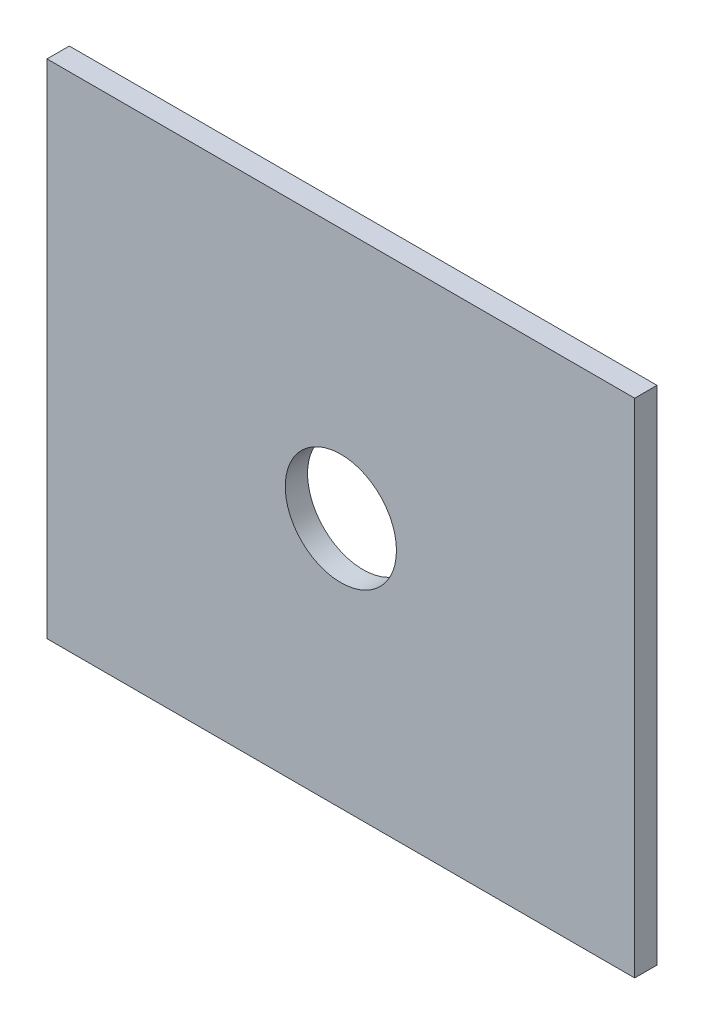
ISO-10303-21;
HEADER;
FILE_DESCRIPTION(('STEP AP214'),'2;1');
FILE_NAME('part.step','',(''),(''),'','','');
FILE_SCHEMA(('AUTOMOTIVE_DESIGN { 1 0 10303 214 1 1 1 1 }'));
ENDSEC;
DATA;
#1=APPLICATION_CONTEXT('core data for automotive mechanical design processes');
#2=APPLICATION_PROTOCOL_DEFINITION('international standard','automotive_design',2000,#1);
#3=PRODUCT_CONTEXT('',#1,'mechanical');
#4=PRODUCT('Part','Part','',(#3));
#5=PRODUCT_RELATED_PRODUCT_CATEGORY('part','',(#4));
#6=PRODUCT_DEFINITION_FORMATION('','',#4);
#7=PRODUCT_DEFINITION_CONTEXT('part definition',#1,'design');
#8=PRODUCT_DEFINITION('design','',#6,#7);
#9=PRODUCT_DEFINITION_SHAPE('','',#8);
#10=(LENGTH_UNIT() NAMED_UNIT(*) SI_UNIT(.MILLI.,.METRE.));
#11=(NAMED_UNIT(*) PLANE_ANGLE_UNIT() SI_UNIT($,.RADIAN.));
#12=(NAMED_UNIT(*) SI_UNIT($,.STERADIAN.) SOLID_ANGLE_UNIT());
#13=UNCERTAINTY_MEASURE_WITH_UNIT(LENGTH_MEASURE(1.E-05),#10,'distance_accuracy_value','');
#14=(GEOMETRIC_REPRESENTATION_CONTEXT(3) GLOBAL_UNCERTAINTY_ASSIGNED_CONTEXT((#13)) GLOBAL_UNIT_ASSIGNED_CONTEXT((#10,
#11,#12)) REPRESENTATION_CONTEXT('',''));
#15=CARTESIAN_POINT('',(0.,0.,0.));
#16=DIRECTION('',(0.,0.,1.));
#17=DIRECTION('',(1.,0.,0.));
#18=AXIS2_PLACEMENT_3D('',#15,#16,#17);
#19=CARTESIAN_POINT('',(-75.1547731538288,-72.4394327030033,6.));
#20=DIRECTION('',(0.,0.,1.));
#21=DIRECTION('',(1.,0.,0.));
#22=AXIS2_PLACEMENT_3D('',#19,#20,#21);
#23=PLANE('',#22);
#24=DIRECTION('',(0.,-1.,0.));
#25=VECTOR('',#24,1.);
#26=CARTESIAN_POINT('',(-75.1547731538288,62.5605672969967,6.));
#27=LINE('',#26,#25);
#28=CARTESIAN_POINT('',(-75.1547731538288,62.5605672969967,6.));
#29=VERTEX_POINT('',#28);
#30=CARTESIAN_POINT('',(-75.1547731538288,-72.4394327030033,6.));
#31=VERTEX_POINT('',#30);
#32=EDGE_CURVE('E83',#29,#31,#27,.T.);
#33=ORIENTED_EDGE('',*,*,#32,.T.);
#34=DIRECTION('',(1.,0.,0.));
#35=VECTOR('',#34,1.);
#36=CARTESIAN_POINT('',(-75.1547731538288,-72.4394327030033,6.));
#37=LINE('',#36,#35);
#38=CARTESIAN_POINT('',(82.8452268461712,-72.4394327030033,6.));
#39=VERTEX_POINT('',#38);
#40=EDGE_CURVE('E78',#31,#39,#37,.T.);
#41=ORIENTED_EDGE('',*,*,#40,.T.);
#42=DIRECTION('',(0.,1.,0.));
#43=VECTOR('',#42,1.);
#44=CARTESIAN_POINT('',(82.8452268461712,62.5605672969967,6.));
#45=LINE('',#44,#43);
#46=CARTESIAN_POINT('',(82.8452268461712,62.5605672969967,6.));
#47=VERTEX_POINT('',#46);
#48=EDGE_CURVE('E81',#39,#47,#45,.T.);
#49=ORIENTED_EDGE('',*,*,#48,.T.);
#50=DIRECTION('',(-1.,0.,0.));
#51=VECTOR('',#50,1.);
#52=CARTESIAN_POINT('',(-75.1547731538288,62.5605672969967,6.));
#53=LINE('',#52,#51);
#54=EDGE_CURVE('E48',#47,#29,#53,.T.);
#55=ORIENTED_EDGE('',*,*,#54,.T.);
#56=EDGE_LOOP('',(#33,#41,#49,#55));
#57=FACE_BOUND('',#56,.T.);
#58=CARTESIAN_POINT('',(3.84522684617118,-4.93943270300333,6.));
#59=DIRECTION('',(0.,0.,1.));
#60=DIRECTION('',(1.,0.,0.));
#61=AXIS2_PLACEMENT_3D('',#58,#59,#60);
#62=CIRCLE('',#61,14.95);
#63=CARTESIAN_POINT('',(18.7952268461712,-4.93943270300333,6.));
#64=VERTEX_POINT('',#63);
#65=EDGE_CURVE('E98',#64,#64,#62,.T.);
#66=ORIENTED_EDGE('',*,*,#65,.F.);
#67=EDGE_LOOP('',(#66));
#68=FACE_BOUND('',#67,.T.);
#69=ADVANCED_FACE('F31',(#57,#68),#23,.T.);
#70=CARTESIAN_POINT('',(-75.1547731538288,-72.4394327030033,0.));
#71=DIRECTION('',(0.,0.,1.));
#72=DIRECTION('',(1.,0.,0.));
#73=AXIS2_PLACEMENT_3D('',#70,#71,#72);
#74=PLANE('',#73);
#75=DIRECTION('',(0.,-1.,0.));
#76=VECTOR('',#75,1.);
#77=CARTESIAN_POINT('',(-75.1547731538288,62.5605672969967,0.));
#78=LINE('',#77,#76);
#79=CARTESIAN_POINT('',(-75.1547731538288,62.5605672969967,0.));
#80=VERTEX_POINT('',#79);
#81=CARTESIAN_POINT('',(-75.1547731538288,-72.4394327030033,0.));
#82=VERTEX_POINT('',#81);
#83=EDGE_CURVE('E95',#80,#82,#78,.T.);
#84=ORIENTED_EDGE('',*,*,#83,.F.);
#85=DIRECTION('',(-1.,0.,0.));
#86=VECTOR('',#85,1.);
#87=CARTESIAN_POINT('',(-75.1547731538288,62.5605672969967,0.));
#88=LINE('',#87,#86);
#89=CARTESIAN_POINT('',(82.8452268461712,62.5605672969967,0.));
#90=VERTEX_POINT('',#89);
#91=EDGE_CURVE('E71',#90,#80,#88,.T.);
#92=ORIENTED_EDGE('',*,*,#91,.F.);
#93=DIRECTION('',(0.,1.,0.));
#94=VECTOR('',#93,1.);
#95=CARTESIAN_POINT('',(82.8452268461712,62.5605672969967,0.));
#96=LINE('',#95,#94);
#97=CARTESIAN_POINT('',(82.8452268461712,-72.4394327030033,0.));
#98=VERTEX_POINT('',#97);
#99=EDGE_CURVE('E65',#98,#90,#96,.T.);
#100=ORIENTED_EDGE('',*,*,#99,.F.);
#101=DIRECTION('',(1.,0.,0.));
#102=VECTOR('',#101,1.);
#103=CARTESIAN_POINT('',(-75.1547731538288,-72.4394327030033,0.));
#104=LINE('',#103,#102);
#105=EDGE_CURVE('E87',#82,#98,#104,.T.);
#106=ORIENTED_EDGE('',*,*,#105,.F.);
#107=EDGE_LOOP('',(#84,#92,#100,#106));
#108=FACE_BOUND('',#107,.T.);
#109=CARTESIAN_POINT('',(3.84522684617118,-4.93943270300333,0.));
#110=DIRECTION('',(0.,0.,1.));
#111=DIRECTION('',(1.,0.,0.));
#112=AXIS2_PLACEMENT_3D('',#109,#110,#111);
#113=CIRCLE('',#112,14.95);
#114=CARTESIAN_POINT('',(18.7952268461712,-4.93943270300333,0.));
#115=VERTEX_POINT('',#114);
#116=EDGE_CURVE('E110',#115,#115,#113,.T.);
#117=ORIENTED_EDGE('',*,*,#116,.T.);
#118=EDGE_LOOP('',(#117));
#119=FACE_BOUND('',#118,.T.);
#120=ADVANCED_FACE('F106',(#108,#119),#74,.F.);
#121=CARTESIAN_POINT('',(-75.1547731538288,62.5605672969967,6.));
#122=DIRECTION('',(1.,0.,0.));
#123=DIRECTION('',(0.,1.,0.));
#124=AXIS2_PLACEMENT_3D('',#121,#122,#123);
#125=PLANE('',#124);
#126=ORIENTED_EDGE('',*,*,#83,.T.);
#127=DIRECTION('',(0.,0.,-1.));
#128=VECTOR('',#127,1.);
#129=CARTESIAN_POINT('',(-75.1547731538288,-72.4394327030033,6.));
#130=LINE('',#129,#128);
#131=EDGE_CURVE('E11',#31,#82,#130,.T.);
#132=ORIENTED_EDGE('',*,*,#131,.F.);
#133=ORIENTED_EDGE('',*,*,#32,.F.);
#134=DIRECTION('',(0.,0.,-1.));
#135=VECTOR('',#134,1.);
#136=CARTESIAN_POINT('',(-75.1547731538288,62.5605672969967,6.));
#137=LINE('',#136,#135);
#138=EDGE_CURVE('E91',#29,#80,#137,.T.);
#139=ORIENTED_EDGE('',*,*,#138,.T.);
#140=EDGE_LOOP('',(#126,#132,#133,#139));
#141=FACE_BOUND('',#140,.T.);
#142=ADVANCED_FACE('F33',(#141),#125,.F.);
#143=CARTESIAN_POINT('',(-75.1547731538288,-72.4394327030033,6.));
#144=DIRECTION('',(0.,1.,0.));
#145=DIRECTION('',(0.,0.,1.));
#146=AXIS2_PLACEMENT_3D('',#143,#144,#145);
#147=PLANE('',#146);
#148=ORIENTED_EDGE('',*,*,#105,.T.);
#149=DIRECTION('',(0.,0.,-1.));
#150=VECTOR('',#149,1.);
#151=CARTESIAN_POINT('',(82.8452268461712,-72.4394327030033,6.));
#152=LINE('',#151,#150);
#153=EDGE_CURVE('E40',#39,#98,#152,.T.);
#154=ORIENTED_EDGE('',*,*,#153,.F.);
#155=ORIENTED_EDGE('',*,*,#40,.F.);
#156=ORIENTED_EDGE('',*,*,#131,.T.);
#157=EDGE_LOOP('',(#148,#154,#155,#156));
#158=FACE_BOUND('',#157,.T.);
#159=ADVANCED_FACE('F86',(#158),#147,.F.);
#160=CARTESIAN_POINT('',(82.8452268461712,62.5605672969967,6.));
#161=DIRECTION('',(-1.,0.,0.));
#162=DIRECTION('',(0.,0.,1.));
#163=AXIS2_PLACEMENT_3D('',#160,#161,#162);
#164=PLANE('',#163);
#165=ORIENTED_EDGE('',*,*,#99,.T.);
#166=DIRECTION('',(0.,0.,-1.));
#167=VECTOR('',#166,1.);
#168=CARTESIAN_POINT('',(82.8452268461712,62.5605672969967,6.));
#169=LINE('',#168,#167);
#170=EDGE_CURVE('E88',#47,#90,#169,.T.);
#171=ORIENTED_EDGE('',*,*,#170,.F.);
#172=ORIENTED_EDGE('',*,*,#48,.F.);
#173=ORIENTED_EDGE('',*,*,#153,.T.);
#174=EDGE_LOOP('',(#165,#171,#172,#173));
#175=FACE_BOUND('',#174,.T.);
#176=ADVANCED_FACE('F89',(#175),#164,.F.);
#177=CARTESIAN_POINT('',(-75.1547731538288,62.5605672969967,6.));
#178=DIRECTION('',(0.,-1.,0.));
#179=DIRECTION('',(0.,0.,-1.));
#180=AXIS2_PLACEMENT_3D('',#177,#178,#179);
#181=PLANE('',#180);
#182=ORIENTED_EDGE('',*,*,#91,.T.);
#183=ORIENTED_EDGE('',*,*,#138,.F.);
#184=ORIENTED_EDGE('',*,*,#54,.F.);
#185=ORIENTED_EDGE('',*,*,#170,.T.);
#186=EDGE_LOOP('',(#182,#183,#184,#185));
#187=FACE_BOUND('',#186,.T.);
#188=ADVANCED_FACE('F103',(#187),#181,.F.);
#189=CARTESIAN_POINT('',(3.84522684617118,-4.93943270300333,6.));
#190=DIRECTION('',(0.,0.,-1.));
#191=DIRECTION('',(-1.,0.,0.));
#192=AXIS2_PLACEMENT_3D('',#189,#190,#191);
#193=CYLINDRICAL_SURFACE('',#192,14.95);
#194=ORIENTED_EDGE('',*,*,#65,.T.);
#195=EDGE_LOOP('',(#194));
#196=FACE_BOUND('',#195,.T.);
#197=ORIENTED_EDGE('',*,*,#116,.F.);
#198=EDGE_LOOP('',(#197));
#199=FACE_BOUND('',#198,.T.);
#200=ADVANCED_FACE('F116',(#196,#199),#193,.F.);
#201=CLOSED_SHELL('',(#69,#120,#142,#159,#176,#188,#200));
#202=MANIFOLD_SOLID_BREP('B2',#201);
#203=ADVANCED_BREP_SHAPE_REPRESENTATION('',(#18,#202),#14);
#204=SHAPE_DEFINITION_REPRESENTATION(#9,#203);
ENDSEC;
END-ISO-10303-21;
